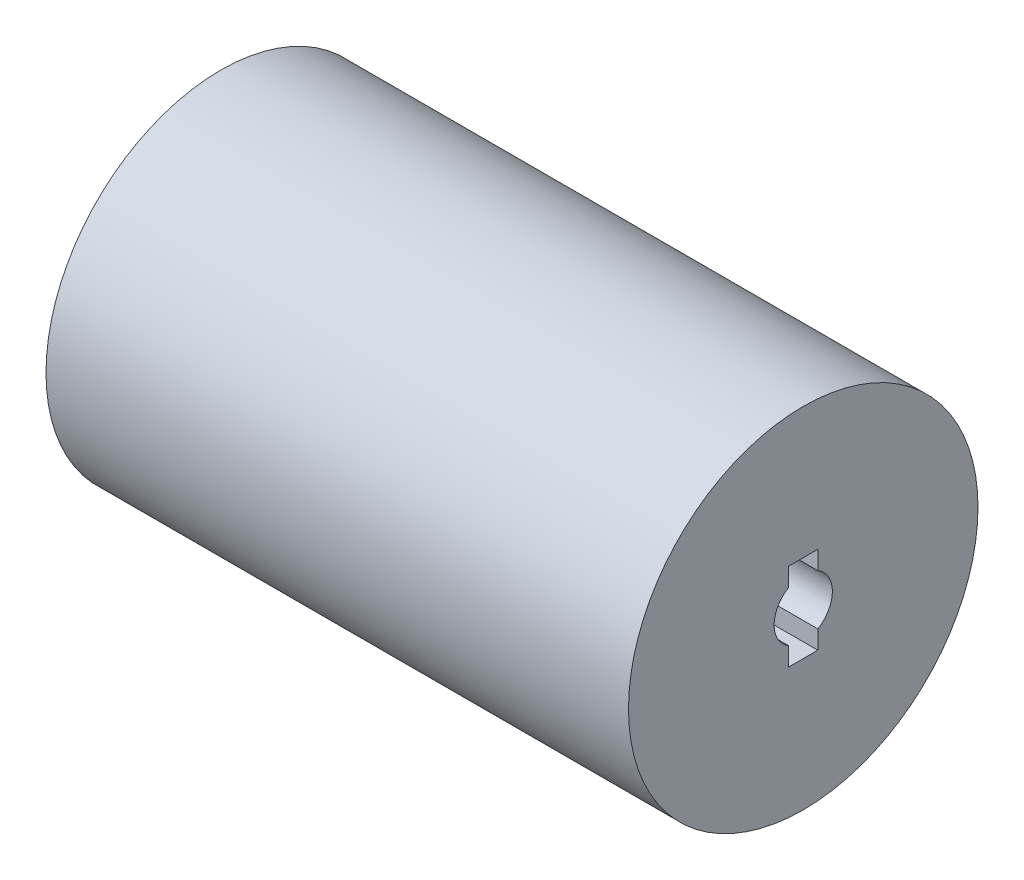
from build123d import *

# Parameters (mm, degrees)
SKETCH2_R               = 30
BOSS_EXTRUDE1_DEPTH     = 100
CUT_EXTRUDE4_DEPTH      = 109.627804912
CUT_EXTRUDE4_DEPTH_BACK = 109.627804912
SKETCH3_R               = 5
CUT_EXTRUDE5_DEPTH      = 109.627804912
CUT_EXTRUDE5_DEPTH_BACK = 109.627804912
SKETCH4_W               = 5
SKETCH4_H               = 15


with BuildPart() as part:
    # Sketch2 → Boss-Extrude1 (new body)
    with BuildSketch(Plane(origin=(0, 0, 0), x_dir=(0, 0, -1), z_dir=(1, 0, 0))):
        Circle(SKETCH2_R)
    extrude(amount=BOSS_EXTRUDE1_DEPTH)

    # Sketch3 → Cut-Extrude4 (cut, two sides: drawn at the far end of the back side and taken through both)
    with BuildSketch(Plane(origin=(0, 0, 0), x_dir=(0, 0, -1), z_dir=(1, 0, 0)).offset(-CUT_EXTRUDE4_DEPTH_BACK)):
        Circle(SKETCH3_R)
    extrude(amount=CUT_EXTRUDE4_DEPTH + CUT_EXTRUDE4_DEPTH_BACK, mode=Mode.SUBTRACT)

    # Sketch4 → Cut-Extrude5 (cut, two sides: drawn at the far end of the back side and taken through both)
    with BuildSketch(Plane.ZY.offset(-CUT_EXTRUDE5_DEPTH_BACK)):
        Rectangle(SKETCH4_W, SKETCH4_H)
    extrude(amount=CUT_EXTRUDE5_DEPTH + CUT_EXTRUDE5_DEPTH_BACK, mode=Mode.SUBTRACT)


solid = part.part
